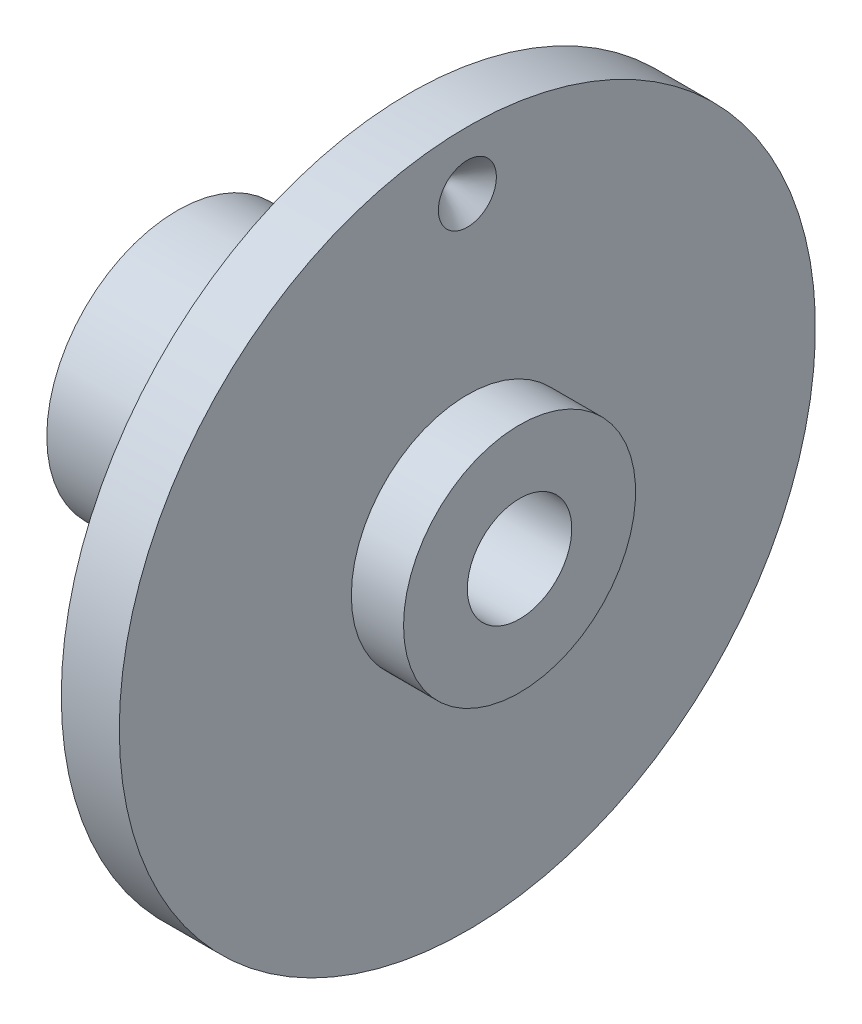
from build123d import *

# Parameters (mm, degrees)
ESQUISSE4_R             = 3.7
ENL_V_MAT_EXTRU_2_DEPTH = 25


with BuildPart() as part:
    # Esquisse1 → Base-R_volution (revolve)
    with BuildSketch(Plane.XY, mode=Mode.PRIVATE) as base_r_volution_sk:
        Polygon((0, 9), (59, 9), (59, 20), (50, 20), (50, 60), (40, 60), (40, 22.5), (0, 22.5), align=None)
    revolve(base_r_volution_sk.sketch.rotate(Axis((-20, 0, 0), (1, 0, 0)), 90), axis=Axis((-20, 0, 0), (1, 0, 0)))

    # Esquisse2 → Enl_vement de mati_re-R_volution1 (revolve, cut)
    with BuildSketch(Plane.XY, mode=Mode.PRIVATE) as enl_vement_de_mati_re_r_volution1_sk:
        Polygon((45, 50), (50, 55), (50, 50), align=None)
    revolve(enl_vement_de_mati_re_r_volution1_sk.sketch.rotate(Axis((21.308708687, 50, 0), (1, 0, 0)), 270), axis=Axis((21.308708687, 50, 0), (1, 0, 0)), mode=Mode.SUBTRACT)

    # Esquisse4 → Enl_v. mat.-Extru.2 (cut, symmetric)
    with BuildSketch(Plane(origin=(0, 0, 0), x_dir=(1, 0, 0), z_dir=(0, -0.7071067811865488, 0.7071067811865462))):
        with Locations(Location((15, 0, 0), (0, 0, 270))):
            Circle(ESQUISSE4_R)
    extrude(amount=ENL_V_MAT_EXTRU_2_DEPTH, both=True, mode=Mode.SUBTRACT)


solid = part.part
